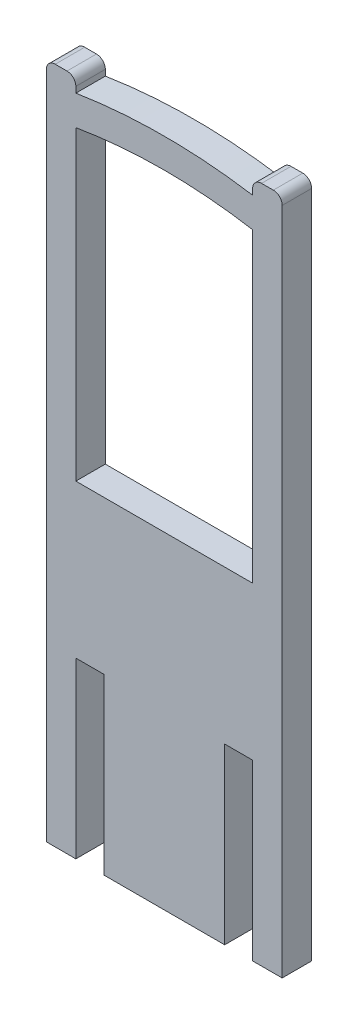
from build123d import *

# Parameters (mm, degrees)
BOSS_EXTRU_1_DEPTH = 10


with BuildPart() as part:
    # Esquisse2 → Boss.-Extru.1 (new body)
    with BuildSketch(Plane.XY):
        with BuildLine():
            Line((33, 239), (37, 239))
            ThreePointArc((37, 239), (39.121320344, 238.121320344), (40, 236))
            Line((40, 236), (40, 9))
            Line((40, 9), (30, 9))
            Line((30, 9), (30, 68))
            Line((30, 68), (20.5, 68))
            Line((20.5, 68), (20.5, 9))
            Line((20.5, 9), (-20.5, 9))
            Line((-20.5, 9), (-20.5, 68))
            Line((-20.5, 68), (-30, 68))
            Line((-30, 68), (-30, 9))
            Line((-30, 9), (-40, 9))
            Line((-40, 9), (-40, 236))
            ThreePointArc((-40, 236), (-39.121320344, 238.121320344), (-37, 239))
            Line((-37, 239), (-33, 239))
            ThreePointArc((-33, 239), (-30.878679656, 238.121320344), (-30, 236))
            Line((-30, 236), (-30, 234))
            ThreePointArc((-30, 234), (0, 236.383369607), (30, 234))
            Line((30, 234), (30, 236))
            ThreePointArc((30, 236), (30.878679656, 238.121320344), (33, 239))
        make_face()
        with BuildLine():
            Line((30, 223.8657631), (30, 120))
            Line((30, 120), (-30, 120))
            Line((-30, 120), (-30, 223.8657631))
            ThreePointArc((-30, 223.8657631), (0, 226.383369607), (30, 223.8657631))
        make_face(mode=Mode.SUBTRACT)
    extrude(amount=BOSS_EXTRU_1_DEPTH)


solid = part.part
